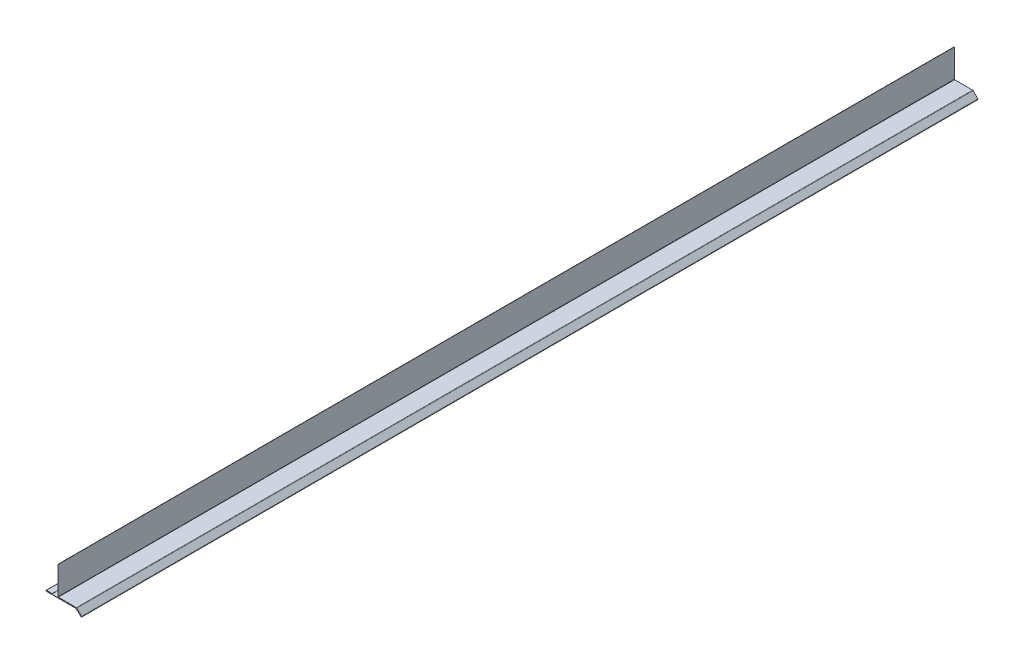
ISO-10303-21;
HEADER;
FILE_DESCRIPTION(('STEP AP214'),'2;1');
FILE_NAME('part.step','',(''),(''),'','','');
FILE_SCHEMA(('AUTOMOTIVE_DESIGN { 1 0 10303 214 1 1 1 1 }'));
ENDSEC;
DATA;
#1=APPLICATION_CONTEXT('core data for automotive mechanical design processes');
#2=APPLICATION_PROTOCOL_DEFINITION('international standard','automotive_design',2000,#1);
#3=PRODUCT_CONTEXT('',#1,'mechanical');
#4=PRODUCT('Part','Part','',(#3));
#5=PRODUCT_RELATED_PRODUCT_CATEGORY('part','',(#4));
#6=PRODUCT_DEFINITION_FORMATION('','',#4);
#7=PRODUCT_DEFINITION_CONTEXT('part definition',#1,'design');
#8=PRODUCT_DEFINITION('design','',#6,#7);
#9=PRODUCT_DEFINITION_SHAPE('','',#8);
#10=(LENGTH_UNIT() NAMED_UNIT(*) SI_UNIT(.MILLI.,.METRE.));
#11=(NAMED_UNIT(*) PLANE_ANGLE_UNIT() SI_UNIT($,.RADIAN.));
#12=(NAMED_UNIT(*) SI_UNIT($,.STERADIAN.) SOLID_ANGLE_UNIT());
#13=UNCERTAINTY_MEASURE_WITH_UNIT(LENGTH_MEASURE(1.E-05),#10,'distance_accuracy_value','');
#14=(GEOMETRIC_REPRESENTATION_CONTEXT(3) GLOBAL_UNCERTAINTY_ASSIGNED_CONTEXT((#13)) GLOBAL_UNIT_ASSIGNED_CONTEXT((#10,
#11,#12)) REPRESENTATION_CONTEXT('',''));
#15=CARTESIAN_POINT('',(0.,0.,0.));
#16=DIRECTION('',(0.,0.,1.));
#17=DIRECTION('',(1.,0.,0.));
#18=AXIS2_PLACEMENT_3D('',#15,#16,#17);
#19=CARTESIAN_POINT('',(-12.7,0.,2000.));
#20=DIRECTION('',(0.,1.,0.));
#21=DIRECTION('',(-1.,0.,0.));
#22=AXIS2_PLACEMENT_3D('',#19,#20,#21);
#23=PLANE('',#22);
#24=DIRECTION('',(1.,0.,0.));
#25=VECTOR('',#24,1.);
#26=CARTESIAN_POINT('',(-12.7,0.,0.));
#27=LINE('',#26,#25);
#28=CARTESIAN_POINT('',(-25.4,0.,0.));
#29=VERTEX_POINT('',#28);
#30=CARTESIAN_POINT('',(-12.7,0.,0.));
#31=VERTEX_POINT('',#30);
#32=EDGE_CURVE('E222',#29,#31,#27,.T.);
#33=ORIENTED_EDGE('',*,*,#32,.T.);
#34=DIRECTION('',(0.,0.,-1.));
#35=VECTOR('',#34,1.);
#36=CARTESIAN_POINT('',(-12.7,0.,2000.));
#37=LINE('',#36,#35);
#38=CARTESIAN_POINT('',(-12.7,0.,2000.));
#39=VERTEX_POINT('',#38);
#40=EDGE_CURVE('E11',#39,#31,#37,.T.);
#41=ORIENTED_EDGE('',*,*,#40,.F.);
#42=DIRECTION('',(1.,0.,0.));
#43=VECTOR('',#42,1.);
#44=CARTESIAN_POINT('',(-12.7,0.,2000.));
#45=LINE('',#44,#43);
#46=CARTESIAN_POINT('',(-25.4,0.,2000.));
#47=VERTEX_POINT('',#46);
#48=EDGE_CURVE('E138',#47,#39,#45,.T.);
#49=ORIENTED_EDGE('',*,*,#48,.F.);
#50=DIRECTION('',(0.,0.,-1.));
#51=VECTOR('',#50,1.);
#52=CARTESIAN_POINT('',(-25.4,0.,2000.));
#53=LINE('',#52,#51);
#54=EDGE_CURVE('E218',#47,#29,#53,.T.);
#55=ORIENTED_EDGE('',*,*,#54,.T.);
#56=EDGE_LOOP('',(#33,#41,#49,#55));
#57=FACE_BOUND('',#56,.T.);
#58=ADVANCED_FACE('F37',(#57),#23,.F.);
#59=CARTESIAN_POINT('',(-12.7,0.507999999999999,2000.));
#60=DIRECTION('',(1.,0.,0.));
#61=DIRECTION('',(0.,0.,-1.));
#62=AXIS2_PLACEMENT_3D('',#59,#60,#61);
#63=PLANE('',#62);
#64=DIRECTION('',(0.,-1.,0.));
#65=VECTOR('',#64,1.);
#66=CARTESIAN_POINT('',(-12.7,0.507999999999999,0.));
#67=LINE('',#66,#65);
#68=CARTESIAN_POINT('',(-12.7,0.507999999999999,0.));
#69=VERTEX_POINT('',#68);
#70=EDGE_CURVE('E225',#69,#31,#67,.T.);
#71=ORIENTED_EDGE('',*,*,#70,.F.);
#72=DIRECTION('',(0.,0.,-1.));
#73=VECTOR('',#72,1.);
#74=CARTESIAN_POINT('',(-12.7,0.507999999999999,2000.));
#75=LINE('',#74,#73);
#76=CARTESIAN_POINT('',(-12.7,0.507999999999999,2000.));
#77=VERTEX_POINT('',#76);
#78=EDGE_CURVE('E45',#77,#69,#75,.T.);
#79=ORIENTED_EDGE('',*,*,#78,.F.);
#80=DIRECTION('',(0.,-1.,0.));
#81=VECTOR('',#80,1.);
#82=CARTESIAN_POINT('',(-12.7,0.507999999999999,2000.));
#83=LINE('',#82,#81);
#84=EDGE_CURVE('E342',#77,#39,#83,.T.);
#85=ORIENTED_EDGE('',*,*,#84,.T.);
#86=ORIENTED_EDGE('',*,*,#40,.T.);
#87=EDGE_LOOP('',(#71,#79,#85,#86));
#88=FACE_BOUND('',#87,.T.);
#89=ADVANCED_FACE('F329',(#88),#63,.T.);
#90=CARTESIAN_POINT('',(-12.7,0.507999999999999,2000.));
#91=DIRECTION('',(0.,1.,0.));
#92=DIRECTION('',(-1.,0.,0.));
#93=AXIS2_PLACEMENT_3D('',#90,#91,#92);
#94=PLANE('',#93);
#95=DIRECTION('',(1.,0.,0.));
#96=VECTOR('',#95,1.);
#97=CARTESIAN_POINT('',(-12.7,0.507999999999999,0.));
#98=LINE('',#97,#96);
#99=CARTESIAN_POINT('',(-25.4,0.507999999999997,0.));
#100=VERTEX_POINT('',#99);
#101=EDGE_CURVE('E228',#100,#69,#98,.T.);
#102=ORIENTED_EDGE('',*,*,#101,.F.);
#103=DIRECTION('',(0.,0.,-1.));
#104=VECTOR('',#103,1.);
#105=CARTESIAN_POINT('',(-25.4,0.507999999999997,2000.));
#106=LINE('',#105,#104);
#107=CARTESIAN_POINT('',(-25.4,0.507999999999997,2000.));
#108=VERTEX_POINT('',#107);
#109=EDGE_CURVE('E319',#108,#100,#106,.T.);
#110=ORIENTED_EDGE('',*,*,#109,.F.);
#111=DIRECTION('',(1.,0.,0.));
#112=VECTOR('',#111,1.);
#113=CARTESIAN_POINT('',(-12.7,0.507999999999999,2000.));
#114=LINE('',#113,#112);
#115=EDGE_CURVE('E326',#108,#77,#114,.T.);
#116=ORIENTED_EDGE('',*,*,#115,.T.);
#117=ORIENTED_EDGE('',*,*,#78,.T.);
#118=EDGE_LOOP('',(#102,#110,#116,#117));
#119=FACE_BOUND('',#118,.T.);
#120=ADVANCED_FACE('F324',(#119),#94,.T.);
#121=CARTESIAN_POINT('',(-25.4,-0.508000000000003,2000.));
#122=DIRECTION('',(0.,0.,-1.));
#123=DIRECTION('',(-1.,0.,0.));
#124=AXIS2_PLACEMENT_3D('',#121,#122,#123);
#125=CYLINDRICAL_SURFACE('',#124,1.016);
#126=CARTESIAN_POINT('',(-25.4,-0.508000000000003,0.));
#127=DIRECTION('',(0.,0.,1.));
#128=DIRECTION('',(1.,0.,0.));
#129=AXIS2_PLACEMENT_3D('',#126,#127,#128);
#130=CIRCLE('',#129,1.016);
#131=CARTESIAN_POINT('',(-25.4,-1.524,0.));
#132=VERTEX_POINT('',#131);
#133=EDGE_CURVE('E231',#132,#100,#130,.F.);
#134=ORIENTED_EDGE('',*,*,#133,.F.);
#135=DIRECTION('',(0.,0.,-1.));
#136=VECTOR('',#135,1.);
#137=CARTESIAN_POINT('',(-25.4,-1.524,2000.));
#138=LINE('',#137,#136);
#139=CARTESIAN_POINT('',(-25.4,-1.524,2000.));
#140=VERTEX_POINT('',#139);
#141=EDGE_CURVE('E317',#140,#132,#138,.T.);
#142=ORIENTED_EDGE('',*,*,#141,.F.);
#143=CARTESIAN_POINT('',(-25.4,-0.508000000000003,2000.));
#144=DIRECTION('',(0.,0.,1.));
#145=DIRECTION('',(1.,0.,0.));
#146=AXIS2_PLACEMENT_3D('',#143,#144,#145);
#147=CIRCLE('',#146,1.016);
#148=EDGE_CURVE('E339',#140,#108,#147,.F.);
#149=ORIENTED_EDGE('',*,*,#148,.T.);
#150=ORIENTED_EDGE('',*,*,#109,.T.);
#151=EDGE_LOOP('',(#134,#142,#149,#150));
#152=FACE_BOUND('',#151,.T.);
#153=ADVANCED_FACE('F336',(#152),#125,.T.);
#154=CARTESIAN_POINT('',(41.0645795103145,-1.524,2000.));
#155=DIRECTION('',(0.,-1.,0.));
#156=DIRECTION('',(1.,0.,0.));
#157=AXIS2_PLACEMENT_3D('',#154,#155,#156);
#158=PLANE('',#157);
#159=DIRECTION('',(-1.,0.,0.));
#160=VECTOR('',#159,1.);
#161=CARTESIAN_POINT('',(41.0645795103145,-1.524,0.));
#162=LINE('',#161,#160);
#163=CARTESIAN_POINT('',(41.0645795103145,-1.524,0.));
#164=VERTEX_POINT('',#163);
#165=EDGE_CURVE('E234',#164,#132,#162,.T.);
#166=ORIENTED_EDGE('',*,*,#165,.F.);
#167=DIRECTION('',(0.,0.,-1.));
#168=VECTOR('',#167,1.);
#169=CARTESIAN_POINT('',(41.0645795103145,-1.524,2000.));
#170=LINE('',#169,#168);
#171=CARTESIAN_POINT('',(41.0645795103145,-1.524,2000.));
#172=VERTEX_POINT('',#171);
#173=EDGE_CURVE('E315',#172,#164,#170,.T.);
#174=ORIENTED_EDGE('',*,*,#173,.F.);
#175=DIRECTION('',(-1.,0.,0.));
#176=VECTOR('',#175,1.);
#177=CARTESIAN_POINT('',(41.0645795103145,-1.524,2000.));
#178=LINE('',#177,#176);
#179=EDGE_CURVE('E344',#172,#140,#178,.T.);
#180=ORIENTED_EDGE('',*,*,#179,.T.);
#181=ORIENTED_EDGE('',*,*,#141,.T.);
#182=EDGE_LOOP('',(#166,#174,#180,#181));
#183=FACE_BOUND('',#182,.T.);
#184=ADVANCED_FACE('F417',(#183),#158,.T.);
#185=CARTESIAN_POINT('',(51.5714791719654,-12.0308996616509,2000.));
#186=DIRECTION('',(-0.707106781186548,-0.707106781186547,0.));
#187=DIRECTION('',(0.707106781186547,-0.707106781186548,0.));
#188=AXIS2_PLACEMENT_3D('',#185,#186,#187);
#189=PLANE('',#188);
#190=DIRECTION('',(-0.707106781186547,0.707106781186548,0.));
#191=VECTOR('',#190,1.);
#192=CARTESIAN_POINT('',(51.5714791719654,-12.0308996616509,0.));
#193=LINE('',#192,#191);
#194=CARTESIAN_POINT('',(51.5714791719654,-12.0308996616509,0.));
#195=VERTEX_POINT('',#194);
#196=EDGE_CURVE('E237',#195,#164,#193,.T.);
#197=ORIENTED_EDGE('',*,*,#196,.F.);
#198=DIRECTION('',(0.,0.,-1.));
#199=VECTOR('',#198,1.);
#200=CARTESIAN_POINT('',(51.5714791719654,-12.0308996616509,2000.));
#201=LINE('',#200,#199);
#202=CARTESIAN_POINT('',(51.5714791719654,-12.0308996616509,2000.));
#203=VERTEX_POINT('',#202);
#204=EDGE_CURVE('E313',#203,#195,#201,.T.);
#205=ORIENTED_EDGE('',*,*,#204,.F.);
#206=DIRECTION('',(-0.707106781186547,0.707106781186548,0.));
#207=VECTOR('',#206,1.);
#208=CARTESIAN_POINT('',(51.5714791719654,-12.0308996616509,2000.));
#209=LINE('',#208,#207);
#210=EDGE_CURVE('E350',#203,#172,#209,.T.);
#211=ORIENTED_EDGE('',*,*,#210,.T.);
#212=ORIENTED_EDGE('',*,*,#173,.T.);
#213=EDGE_LOOP('',(#197,#205,#211,#212));
#214=FACE_BOUND('',#213,.T.);
#215=ADVANCED_FACE('F420',(#214),#189,.T.);
#216=CARTESIAN_POINT('',(52.2898996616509,-11.3124791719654,2000.));
#217=DIRECTION('',(0.,0.,-1.));
#218=DIRECTION('',(-1.,0.,0.));
#219=AXIS2_PLACEMENT_3D('',#216,#217,#218);
#220=CYLINDRICAL_SURFACE('',#219,1.01599999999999);
#221=CARTESIAN_POINT('',(52.2898996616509,-11.3124791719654,0.));
#222=DIRECTION('',(0.,0.,1.));
#223=DIRECTION('',(1.,0.,0.));
#224=AXIS2_PLACEMENT_3D('',#221,#222,#223);
#225=CIRCLE('',#224,1.01599999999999);
#226=CARTESIAN_POINT('',(53.0083201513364,-10.5940586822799,0.));
#227=VERTEX_POINT('',#226);
#228=EDGE_CURVE('E240',#227,#195,#225,.F.);
#229=ORIENTED_EDGE('',*,*,#228,.F.);
#230=DIRECTION('',(0.,0.,-1.));
#231=VECTOR('',#230,1.);
#232=CARTESIAN_POINT('',(53.0083201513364,-10.5940586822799,2000.));
#233=LINE('',#232,#231);
#234=CARTESIAN_POINT('',(53.0083201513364,-10.5940586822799,2000.));
#235=VERTEX_POINT('',#234);
#236=EDGE_CURVE('E311',#235,#227,#233,.T.);
#237=ORIENTED_EDGE('',*,*,#236,.F.);
#238=CARTESIAN_POINT('',(52.2898996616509,-11.3124791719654,2000.));
#239=DIRECTION('',(0.,0.,1.));
#240=DIRECTION('',(1.,0.,0.));
#241=AXIS2_PLACEMENT_3D('',#238,#239,#240);
#242=CIRCLE('',#241,1.01599999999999);
#243=EDGE_CURVE('E353',#235,#203,#242,.F.);
#244=ORIENTED_EDGE('',*,*,#243,.T.);
#245=ORIENTED_EDGE('',*,*,#204,.T.);
#246=EDGE_LOOP('',(#229,#237,#244,#245));
#247=FACE_BOUND('',#246,.T.);
#248=ADVANCED_FACE('F424',(#247),#220,.T.);
#249=CARTESIAN_POINT('',(42.3526307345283,0.0616307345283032,2000.));
#250=DIRECTION('',(0.707106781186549,0.707106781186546,0.));
#251=DIRECTION('',(-0.707106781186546,0.707106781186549,0.));
#252=AXIS2_PLACEMENT_3D('',#249,#250,#251);
#253=PLANE('',#252);
#254=DIRECTION('',(0.707106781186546,-0.707106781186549,0.));
#255=VECTOR('',#254,1.);
#256=CARTESIAN_POINT('',(42.3526307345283,0.0616307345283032,0.));
#257=LINE('',#256,#255);
#258=CARTESIAN_POINT('',(42.3526307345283,0.0616307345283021,0.));
#259=VERTEX_POINT('',#258);
#260=EDGE_CURVE('E243',#259,#227,#257,.T.);
#261=ORIENTED_EDGE('',*,*,#260,.F.);
#262=DIRECTION('',(0.,0.,-1.));
#263=VECTOR('',#262,1.);
#264=CARTESIAN_POINT('',(42.3526307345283,0.0616307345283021,2000.));
#265=LINE('',#264,#263);
#266=CARTESIAN_POINT('',(42.3526307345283,0.0616307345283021,2000.));
#267=VERTEX_POINT('',#266);
#268=EDGE_CURVE('E309',#267,#259,#265,.T.);
#269=ORIENTED_EDGE('',*,*,#268,.F.);
#270=DIRECTION('',(0.707106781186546,-0.707106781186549,0.));
#271=VECTOR('',#270,1.);
#272=CARTESIAN_POINT('',(42.3526307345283,0.0616307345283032,2000.));
#273=LINE('',#272,#271);
#274=EDGE_CURVE('E356',#267,#235,#273,.T.);
#275=ORIENTED_EDGE('',*,*,#274,.T.);
#276=ORIENTED_EDGE('',*,*,#236,.T.);
#277=EDGE_LOOP('',(#261,#269,#275,#276));
#278=FACE_BOUND('',#277,.T.);
#279=ADVANCED_FACE('F428',(#278),#253,.T.);
#280=CARTESIAN_POINT('',(41.275,-1.016,2000.));
#281=DIRECTION('',(0.,0.,-1.));
#282=DIRECTION('',(-1.,0.,0.));
#283=AXIS2_PLACEMENT_3D('',#280,#281,#282);
#284=CYLINDRICAL_SURFACE('',#283,1.524);
#285=CARTESIAN_POINT('',(41.275,-1.016,0.));
#286=DIRECTION('',(0.,0.,1.));
#287=DIRECTION('',(1.,0.,0.));
#288=AXIS2_PLACEMENT_3D('',#285,#286,#287);
#289=CIRCLE('',#288,1.524);
#290=CARTESIAN_POINT('',(41.275,0.508000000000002,0.));
#291=VERTEX_POINT('',#290);
#292=EDGE_CURVE('E246',#291,#259,#289,.F.);
#293=ORIENTED_EDGE('',*,*,#292,.F.);
#294=DIRECTION('',(0.,0.,-1.));
#295=VECTOR('',#294,1.);
#296=CARTESIAN_POINT('',(41.275,0.508000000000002,2000.));
#297=LINE('',#296,#295);
#298=CARTESIAN_POINT('',(41.275,0.508000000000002,2000.));
#299=VERTEX_POINT('',#298);
#300=EDGE_CURVE('E307',#299,#291,#297,.T.);
#301=ORIENTED_EDGE('',*,*,#300,.F.);
#302=CARTESIAN_POINT('',(41.275,-1.016,2000.));
#303=DIRECTION('',(0.,0.,1.));
#304=DIRECTION('',(1.,0.,0.));
#305=AXIS2_PLACEMENT_3D('',#302,#303,#304);
#306=CIRCLE('',#305,1.524);
#307=EDGE_CURVE('E359',#299,#267,#306,.F.);
#308=ORIENTED_EDGE('',*,*,#307,.T.);
#309=ORIENTED_EDGE('',*,*,#268,.T.);
#310=EDGE_LOOP('',(#293,#301,#308,#309));
#311=FACE_BOUND('',#310,.T.);
#312=ADVANCED_FACE('F432',(#311),#284,.T.);
#313=CARTESIAN_POINT('',(1.,0.508,2000.));
#314=DIRECTION('',(0.,1.,0.));
#315=DIRECTION('',(0.,0.,1.));
#316=AXIS2_PLACEMENT_3D('',#313,#314,#315);
#317=PLANE('',#316);
#318=DIRECTION('',(1.,0.,0.));
#319=VECTOR('',#318,1.);
#320=CARTESIAN_POINT('',(1.,0.508,0.));
#321=LINE('',#320,#319);
#322=CARTESIAN_POINT('',(1.,0.508,0.));
#323=VERTEX_POINT('',#322);
#324=EDGE_CURVE('E249',#323,#291,#321,.T.);
#325=ORIENTED_EDGE('',*,*,#324,.F.);
#326=DIRECTION('',(0.,0.,-1.));
#327=VECTOR('',#326,1.);
#328=CARTESIAN_POINT('',(1.,0.508,2000.));
#329=LINE('',#328,#327);
#330=CARTESIAN_POINT('',(1.,0.508,2000.));
#331=VERTEX_POINT('',#330);
#332=EDGE_CURVE('E305',#331,#323,#329,.T.);
#333=ORIENTED_EDGE('',*,*,#332,.F.);
#334=DIRECTION('',(1.,0.,0.));
#335=VECTOR('',#334,1.);
#336=CARTESIAN_POINT('',(1.,0.508,2000.));
#337=LINE('',#336,#335);
#338=EDGE_CURVE('E362',#331,#299,#337,.T.);
#339=ORIENTED_EDGE('',*,*,#338,.T.);
#340=ORIENTED_EDGE('',*,*,#300,.T.);
#341=EDGE_LOOP('',(#325,#333,#339,#340));
#342=FACE_BOUND('',#341,.T.);
#343=ADVANCED_FACE('F436',(#342),#317,.T.);
#344=CARTESIAN_POINT('',(1.,1.,2000.));
#345=DIRECTION('',(0.,0.,-1.));
#346=DIRECTION('',(-1.,0.,0.));
#347=AXIS2_PLACEMENT_3D('',#344,#345,#346);
#348=CYLINDRICAL_SURFACE('',#347,0.492);
#349=CARTESIAN_POINT('',(1.,1.,0.));
#350=DIRECTION('',(0.,0.,1.));
#351=DIRECTION('',(1.,0.,0.));
#352=AXIS2_PLACEMENT_3D('',#349,#350,#351);
#353=CIRCLE('',#352,0.492);
#354=CARTESIAN_POINT('',(0.508,1.,0.));
#355=VERTEX_POINT('',#354);
#356=EDGE_CURVE('E252',#355,#323,#353,.T.);
#357=ORIENTED_EDGE('',*,*,#356,.F.);
#358=DIRECTION('',(0.,0.,-1.));
#359=VECTOR('',#358,1.);
#360=CARTESIAN_POINT('',(0.508,1.,2000.));
#361=LINE('',#360,#359);
#362=CARTESIAN_POINT('',(0.508,1.,2000.));
#363=VERTEX_POINT('',#362);
#364=EDGE_CURVE('E303',#363,#355,#361,.T.);
#365=ORIENTED_EDGE('',*,*,#364,.F.);
#366=CARTESIAN_POINT('',(1.,1.,2000.));
#367=DIRECTION('',(0.,0.,1.));
#368=DIRECTION('',(1.,0.,0.));
#369=AXIS2_PLACEMENT_3D('',#366,#367,#368);
#370=CIRCLE('',#369,0.492);
#371=EDGE_CURVE('E365',#363,#331,#370,.T.);
#372=ORIENTED_EDGE('',*,*,#371,.T.);
#373=ORIENTED_EDGE('',*,*,#332,.T.);
#374=EDGE_LOOP('',(#357,#365,#372,#373));
#375=FACE_BOUND('',#374,.T.);
#376=ADVANCED_FACE('F440',(#375),#348,.F.);
#377=CARTESIAN_POINT('',(0.508,1.,2000.));
#378=DIRECTION('',(1.,0.,0.));
#379=DIRECTION('',(0.,0.,-1.));
#380=AXIS2_PLACEMENT_3D('',#377,#378,#379);
#381=PLANE('',#380);
#382=DIRECTION('',(0.,1.,0.));
#383=VECTOR('',#382,1.);
#384=CARTESIAN_POINT('',(0.508,1.,0.));
#385=LINE('',#384,#383);
#386=CARTESIAN_POINT('',(0.508,63.5,0.));
#387=VERTEX_POINT('',#386);
#388=EDGE_CURVE('E255',#387,#355,#385,.F.);
#389=ORIENTED_EDGE('',*,*,#388,.F.);
#390=DIRECTION('',(0.,0.,-1.));
#391=VECTOR('',#390,1.);
#392=CARTESIAN_POINT('',(0.508,63.5,2000.));
#393=LINE('',#392,#391);
#394=CARTESIAN_POINT('',(0.508,63.5,2000.));
#395=VERTEX_POINT('',#394);
#396=EDGE_CURVE('E301',#395,#387,#393,.T.);
#397=ORIENTED_EDGE('',*,*,#396,.F.);
#398=DIRECTION('',(0.,1.,0.));
#399=VECTOR('',#398,1.);
#400=CARTESIAN_POINT('',(0.508,1.,2000.));
#401=LINE('',#400,#399);
#402=EDGE_CURVE('E368',#395,#363,#401,.F.);
#403=ORIENTED_EDGE('',*,*,#402,.T.);
#404=ORIENTED_EDGE('',*,*,#364,.T.);
#405=EDGE_LOOP('',(#389,#397,#403,#404));
#406=FACE_BOUND('',#405,.T.);
#407=ADVANCED_FACE('F444',(#406),#381,.T.);
#408=CARTESIAN_POINT('',(0.,63.5,2000.));
#409=DIRECTION('',(0.,1.,0.));
#410=DIRECTION('',(0.,0.,1.));
#411=AXIS2_PLACEMENT_3D('',#408,#409,#410);
#412=PLANE('',#411);
#413=DIRECTION('',(1.,0.,0.));
#414=VECTOR('',#413,1.);
#415=CARTESIAN_POINT('',(0.,63.5,0.));
#416=LINE('',#415,#414);
#417=CARTESIAN_POINT('',(0.,63.5,0.));
#418=VERTEX_POINT('',#417);
#419=EDGE_CURVE('E258',#418,#387,#416,.T.);
#420=ORIENTED_EDGE('',*,*,#419,.F.);
#421=DIRECTION('',(0.,0.,-1.));
#422=VECTOR('',#421,1.);
#423=CARTESIAN_POINT('',(0.,63.5,2000.));
#424=LINE('',#423,#422);
#425=CARTESIAN_POINT('',(0.,63.5,2000.));
#426=VERTEX_POINT('',#425);
#427=EDGE_CURVE('E299',#426,#418,#424,.T.);
#428=ORIENTED_EDGE('',*,*,#427,.F.);
#429=DIRECTION('',(1.,0.,0.));
#430=VECTOR('',#429,1.);
#431=CARTESIAN_POINT('',(0.,63.5,2000.));
#432=LINE('',#431,#430);
#433=EDGE_CURVE('E371',#426,#395,#432,.T.);
#434=ORIENTED_EDGE('',*,*,#433,.T.);
#435=ORIENTED_EDGE('',*,*,#396,.T.);
#436=EDGE_LOOP('',(#420,#428,#434,#435));
#437=FACE_BOUND('',#436,.T.);
#438=ADVANCED_FACE('F448',(#437),#412,.T.);
#439=CARTESIAN_POINT('',(0.,1.,2000.));
#440=DIRECTION('',(1.,0.,0.));
#441=DIRECTION('',(0.,0.,-1.));
#442=AXIS2_PLACEMENT_3D('',#439,#440,#441);
#443=PLANE('',#442);
#444=DIRECTION('',(0.,-1.,0.));
#445=VECTOR('',#444,1.);
#446=CARTESIAN_POINT('',(0.,1.,0.));
#447=LINE('',#446,#445);
#448=CARTESIAN_POINT('',(0.,1.,0.));
#449=VERTEX_POINT('',#448);
#450=EDGE_CURVE('E261',#418,#449,#447,.T.);
#451=ORIENTED_EDGE('',*,*,#450,.T.);
#452=DIRECTION('',(0.,0.,-1.));
#453=VECTOR('',#452,1.);
#454=CARTESIAN_POINT('',(0.,1.,2000.));
#455=LINE('',#454,#453);
#456=CARTESIAN_POINT('',(0.,1.,2000.));
#457=VERTEX_POINT('',#456);
#458=EDGE_CURVE('E296',#457,#449,#455,.T.);
#459=ORIENTED_EDGE('',*,*,#458,.F.);
#460=DIRECTION('',(0.,-1.,0.));
#461=VECTOR('',#460,1.);
#462=CARTESIAN_POINT('',(0.,1.,2000.));
#463=LINE('',#462,#461);
#464=EDGE_CURVE('E374',#426,#457,#463,.T.);
#465=ORIENTED_EDGE('',*,*,#464,.F.);
#466=ORIENTED_EDGE('',*,*,#427,.T.);
#467=EDGE_LOOP('',(#451,#459,#465,#466));
#468=FACE_BOUND('',#467,.T.);
#469=ADVANCED_FACE('F452',(#468),#443,.F.);
#470=CARTESIAN_POINT('',(1.,1.,2000.));
#471=DIRECTION('',(0.,0.,-1.));
#472=DIRECTION('',(-1.,0.,0.));
#473=AXIS2_PLACEMENT_3D('',#470,#471,#472);
#474=CYLINDRICAL_SURFACE('',#473,1.);
#475=CARTESIAN_POINT('',(1.,1.,0.));
#476=DIRECTION('',(0.,0.,1.));
#477=DIRECTION('',(1.,0.,0.));
#478=AXIS2_PLACEMENT_3D('',#475,#476,#477);
#479=CIRCLE('',#478,1.);
#480=CARTESIAN_POINT('',(1.,0.,0.));
#481=VERTEX_POINT('',#480);
#482=EDGE_CURVE('E263',#449,#481,#479,.T.);
#483=ORIENTED_EDGE('',*,*,#482,.T.);
#484=DIRECTION('',(0.,0.,-1.));
#485=VECTOR('',#484,1.);
#486=CARTESIAN_POINT('',(1.,0.,2000.));
#487=LINE('',#486,#485);
#488=CARTESIAN_POINT('',(1.,0.,2000.));
#489=VERTEX_POINT('',#488);
#490=EDGE_CURVE('E293',#489,#481,#487,.T.);
#491=ORIENTED_EDGE('',*,*,#490,.F.);
#492=CARTESIAN_POINT('',(1.,1.,2000.));
#493=DIRECTION('',(0.,0.,1.));
#494=DIRECTION('',(1.,0.,0.));
#495=AXIS2_PLACEMENT_3D('',#492,#493,#494);
#496=CIRCLE('',#495,1.);
#497=EDGE_CURVE('E376',#457,#489,#496,.T.);
#498=ORIENTED_EDGE('',*,*,#497,.F.);
#499=ORIENTED_EDGE('',*,*,#458,.T.);
#500=EDGE_LOOP('',(#483,#491,#498,#499));
#501=FACE_BOUND('',#500,.T.);
#502=ADVANCED_FACE('F456',(#501),#474,.T.);
#503=CARTESIAN_POINT('',(1.,0.,2000.));
#504=DIRECTION('',(0.,1.,0.));
#505=DIRECTION('',(0.,0.,1.));
#506=AXIS2_PLACEMENT_3D('',#503,#504,#505);
#507=PLANE('',#506);
#508=DIRECTION('',(1.,0.,0.));
#509=VECTOR('',#508,1.);
#510=CARTESIAN_POINT('',(1.,0.,0.));
#511=LINE('',#510,#509);
#512=CARTESIAN_POINT('',(41.275,0.,0.));
#513=VERTEX_POINT('',#512);
#514=EDGE_CURVE('E265',#481,#513,#511,.T.);
#515=ORIENTED_EDGE('',*,*,#514,.T.);
#516=DIRECTION('',(0.,0.,-1.));
#517=VECTOR('',#516,1.);
#518=CARTESIAN_POINT('',(41.275,0.,2000.));
#519=LINE('',#518,#517);
#520=CARTESIAN_POINT('',(41.275,0.,2000.));
#521=VERTEX_POINT('',#520);
#522=EDGE_CURVE('E290',#521,#513,#519,.T.);
#523=ORIENTED_EDGE('',*,*,#522,.F.);
#524=DIRECTION('',(1.,0.,0.));
#525=VECTOR('',#524,1.);
#526=CARTESIAN_POINT('',(1.,0.,2000.));
#527=LINE('',#526,#525);
#528=EDGE_CURVE('E378',#489,#521,#527,.T.);
#529=ORIENTED_EDGE('',*,*,#528,.F.);
#530=ORIENTED_EDGE('',*,*,#490,.T.);
#531=EDGE_LOOP('',(#515,#523,#529,#530));
#532=FACE_BOUND('',#531,.T.);
#533=ADVANCED_FACE('F460',(#532),#507,.F.);
#534=CARTESIAN_POINT('',(41.275,-1.016,2000.));
#535=DIRECTION('',(0.,0.,-1.));
#536=DIRECTION('',(-1.,0.,0.));
#537=AXIS2_PLACEMENT_3D('',#534,#535,#536);
#538=CYLINDRICAL_SURFACE('',#537,1.016);
#539=CARTESIAN_POINT('',(41.275,-1.016,0.));
#540=DIRECTION('',(0.,0.,-1.));
#541=DIRECTION('',(1.,0.,0.));
#542=AXIS2_PLACEMENT_3D('',#539,#540,#541);
#543=CIRCLE('',#542,1.016);
#544=CARTESIAN_POINT('',(41.9934204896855,-0.297579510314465,0.));
#545=VERTEX_POINT('',#544);
#546=EDGE_CURVE('E267',#513,#545,#543,.T.);
#547=ORIENTED_EDGE('',*,*,#546,.T.);
#548=DIRECTION('',(0.,0.,-1.));
#549=VECTOR('',#548,1.);
#550=CARTESIAN_POINT('',(41.9934204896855,-0.297579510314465,2000.));
#551=LINE('',#550,#549);
#552=CARTESIAN_POINT('',(41.9934204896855,-0.297579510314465,2000.));
#553=VERTEX_POINT('',#552);
#554=EDGE_CURVE('E287',#553,#545,#551,.T.);
#555=ORIENTED_EDGE('',*,*,#554,.F.);
#556=CARTESIAN_POINT('',(41.275,-1.016,2000.));
#557=DIRECTION('',(0.,0.,-1.));
#558=DIRECTION('',(1.,0.,0.));
#559=AXIS2_PLACEMENT_3D('',#556,#557,#558);
#560=CIRCLE('',#559,1.016);
#561=EDGE_CURVE('E380',#521,#553,#560,.T.);
#562=ORIENTED_EDGE('',*,*,#561,.F.);
#563=ORIENTED_EDGE('',*,*,#522,.T.);
#564=EDGE_LOOP('',(#547,#555,#562,#563));
#565=FACE_BOUND('',#564,.T.);
#566=ADVANCED_FACE('F464',(#565),#538,.F.);
#567=CARTESIAN_POINT('',(41.9934204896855,-0.297579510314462,2000.));
#568=DIRECTION('',(0.707106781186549,0.707106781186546,0.));
#569=DIRECTION('',(-0.707106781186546,0.707106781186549,0.));
#570=AXIS2_PLACEMENT_3D('',#567,#568,#569);
#571=PLANE('',#570);
#572=DIRECTION('',(0.707106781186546,-0.707106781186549,0.));
#573=VECTOR('',#572,1.);
#574=CARTESIAN_POINT('',(41.9934204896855,-0.297579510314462,0.));
#575=LINE('',#574,#573);
#576=CARTESIAN_POINT('',(52.6491099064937,-10.9532689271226,0.));
#577=VERTEX_POINT('',#576);
#578=EDGE_CURVE('E269',#545,#577,#575,.T.);
#579=ORIENTED_EDGE('',*,*,#578,.T.);
#580=DIRECTION('',(0.,0.,-1.));
#581=VECTOR('',#580,1.);
#582=CARTESIAN_POINT('',(52.6491099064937,-10.9532689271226,2000.));
#583=LINE('',#582,#581);
#584=CARTESIAN_POINT('',(52.6491099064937,-10.9532689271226,2000.));
#585=VERTEX_POINT('',#584);
#586=EDGE_CURVE('E284',#585,#577,#583,.T.);
#587=ORIENTED_EDGE('',*,*,#586,.F.);
#588=DIRECTION('',(0.707106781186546,-0.707106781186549,0.));
#589=VECTOR('',#588,1.);
#590=CARTESIAN_POINT('',(41.9934204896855,-0.297579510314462,2000.));
#591=LINE('',#590,#589);
#592=EDGE_CURVE('E382',#553,#585,#591,.T.);
#593=ORIENTED_EDGE('',*,*,#592,.F.);
#594=ORIENTED_EDGE('',*,*,#554,.T.);
#595=EDGE_LOOP('',(#579,#587,#593,#594));
#596=FACE_BOUND('',#595,.T.);
#597=ADVANCED_FACE('F468',(#596),#571,.F.);
#598=CARTESIAN_POINT('',(52.2898996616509,-11.3124791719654,2000.));
#599=DIRECTION('',(0.,0.,-1.));
#600=DIRECTION('',(-1.,0.,0.));
#601=AXIS2_PLACEMENT_3D('',#598,#599,#600);
#602=CYLINDRICAL_SURFACE('',#601,0.507999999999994);
#603=CARTESIAN_POINT('',(52.2898996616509,-11.3124791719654,0.));
#604=DIRECTION('',(0.,0.,-1.));
#605=DIRECTION('',(-1.,0.,0.));
#606=AXIS2_PLACEMENT_3D('',#603,#604,#605);
#607=CIRCLE('',#606,0.507999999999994);
#608=CARTESIAN_POINT('',(51.9306894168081,-11.6716894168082,0.));
#609=VERTEX_POINT('',#608);
#610=EDGE_CURVE('E271',#577,#609,#607,.T.);
#611=ORIENTED_EDGE('',*,*,#610,.T.);
#612=DIRECTION('',(0.,0.,-1.));
#613=VECTOR('',#612,1.);
#614=CARTESIAN_POINT('',(51.9306894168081,-11.6716894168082,2000.));
#615=LINE('',#614,#613);
#616=CARTESIAN_POINT('',(51.9306894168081,-11.6716894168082,2000.));
#617=VERTEX_POINT('',#616);
#618=EDGE_CURVE('E281',#617,#609,#615,.T.);
#619=ORIENTED_EDGE('',*,*,#618,.F.);
#620=CARTESIAN_POINT('',(52.2898996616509,-11.3124791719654,2000.));
#621=DIRECTION('',(0.,0.,-1.));
#622=DIRECTION('',(-1.,0.,0.));
#623=AXIS2_PLACEMENT_3D('',#620,#621,#622);
#624=CIRCLE('',#623,0.507999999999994);
#625=EDGE_CURVE('E384',#585,#617,#624,.T.);
#626=ORIENTED_EDGE('',*,*,#625,.F.);
#627=ORIENTED_EDGE('',*,*,#586,.T.);
#628=EDGE_LOOP('',(#611,#619,#626,#627));
#629=FACE_BOUND('',#628,.T.);
#630=ADVANCED_FACE('F390',(#629),#602,.F.);
#631=CARTESIAN_POINT('',(51.9306894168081,-11.6716894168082,2000.));
#632=DIRECTION('',(-0.707106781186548,-0.707106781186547,0.));
#633=DIRECTION('',(0.707106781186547,-0.707106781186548,0.));
#634=AXIS2_PLACEMENT_3D('',#631,#632,#633);
#635=PLANE('',#634);
#636=DIRECTION('',(-0.707106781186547,0.707106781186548,0.));
#637=VECTOR('',#636,1.);
#638=CARTESIAN_POINT('',(51.9306894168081,-11.6716894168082,0.));
#639=LINE('',#638,#637);
#640=CARTESIAN_POINT('',(41.4237897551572,-1.16478975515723,0.));
#641=VERTEX_POINT('',#640);
#642=EDGE_CURVE('E273',#609,#641,#639,.T.);
#643=ORIENTED_EDGE('',*,*,#642,.T.);
#644=DIRECTION('',(0.,0.,-1.));
#645=VECTOR('',#644,1.);
#646=CARTESIAN_POINT('',(41.4237897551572,-1.16478975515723,2000.));
#647=LINE('',#646,#645);
#648=CARTESIAN_POINT('',(41.4237897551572,-1.16478975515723,2000.));
#649=VERTEX_POINT('',#648);
#650=EDGE_CURVE('E213',#649,#641,#647,.T.);
#651=ORIENTED_EDGE('',*,*,#650,.F.);
#652=DIRECTION('',(-0.707106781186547,0.707106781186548,0.));
#653=VECTOR('',#652,1.);
#654=CARTESIAN_POINT('',(51.9306894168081,-11.6716894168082,2000.));
#655=LINE('',#654,#653);
#656=EDGE_CURVE('E204',#617,#649,#655,.T.);
#657=ORIENTED_EDGE('',*,*,#656,.F.);
#658=ORIENTED_EDGE('',*,*,#618,.T.);
#659=EDGE_LOOP('',(#643,#651,#657,#658));
#660=FACE_BOUND('',#659,.T.);
#661=ADVANCED_FACE('F394',(#660),#635,.F.);
#662=CARTESIAN_POINT('',(41.0645795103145,-1.524,2000.));
#663=DIRECTION('',(0.,0.,-1.));
#664=DIRECTION('',(-1.,0.,0.));
#665=AXIS2_PLACEMENT_3D('',#662,#663,#664);
#666=CYLINDRICAL_SURFACE('',#665,0.508000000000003);
#667=CARTESIAN_POINT('',(41.0645795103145,-1.524,0.));
#668=DIRECTION('',(0.,0.,1.));
#669=DIRECTION('',(-1.,0.,0.));
#670=AXIS2_PLACEMENT_3D('',#667,#668,#669);
#671=CIRCLE('',#670,0.508000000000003);
#672=CARTESIAN_POINT('',(41.0645795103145,-1.01599999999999,0.));
#673=VERTEX_POINT('',#672);
#674=EDGE_CURVE('E212',#641,#673,#671,.T.);
#675=ORIENTED_EDGE('',*,*,#674,.T.);
#676=DIRECTION('',(0.,0.,-1.));
#677=VECTOR('',#676,1.);
#678=CARTESIAN_POINT('',(41.0645795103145,-1.01599999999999,2000.));
#679=LINE('',#678,#677);
#680=CARTESIAN_POINT('',(41.0645795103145,-1.01599999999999,2000.));
#681=VERTEX_POINT('',#680);
#682=EDGE_CURVE('E209',#681,#673,#679,.T.);
#683=ORIENTED_EDGE('',*,*,#682,.F.);
#684=CARTESIAN_POINT('',(41.0645795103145,-1.524,2000.));
#685=DIRECTION('',(0.,0.,1.));
#686=DIRECTION('',(-1.,0.,0.));
#687=AXIS2_PLACEMENT_3D('',#684,#685,#686);
#688=CIRCLE('',#687,0.508000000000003);
#689=EDGE_CURVE('E198',#649,#681,#688,.T.);
#690=ORIENTED_EDGE('',*,*,#689,.F.);
#691=ORIENTED_EDGE('',*,*,#650,.T.);
#692=EDGE_LOOP('',(#675,#683,#690,#691));
#693=FACE_BOUND('',#692,.T.);
#694=ADVANCED_FACE('F210',(#693),#666,.T.);
#695=CARTESIAN_POINT('',(41.0645795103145,-1.016,2000.));
#696=DIRECTION('',(0.,-1.,0.));
#697=DIRECTION('',(1.,0.,0.));
#698=AXIS2_PLACEMENT_3D('',#695,#696,#697);
#699=PLANE('',#698);
#700=DIRECTION('',(-1.,0.,0.));
#701=VECTOR('',#700,1.);
#702=CARTESIAN_POINT('',(41.0645795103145,-1.016,0.));
#703=LINE('',#702,#701);
#704=CARTESIAN_POINT('',(-25.4,-1.01600000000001,0.));
#705=VERTEX_POINT('',#704);
#706=EDGE_CURVE('E126',#673,#705,#703,.T.);
#707=ORIENTED_EDGE('',*,*,#706,.T.);
#708=DIRECTION('',(0.,0.,-1.));
#709=VECTOR('',#708,1.);
#710=CARTESIAN_POINT('',(-25.4,-1.01600000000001,2000.));
#711=LINE('',#710,#709);
#712=CARTESIAN_POINT('',(-25.4,-1.01600000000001,2000.));
#713=VERTEX_POINT('',#712);
#714=EDGE_CURVE('E214',#713,#705,#711,.T.);
#715=ORIENTED_EDGE('',*,*,#714,.F.);
#716=DIRECTION('',(-1.,0.,0.));
#717=VECTOR('',#716,1.);
#718=CARTESIAN_POINT('',(41.0645795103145,-1.016,2000.));
#719=LINE('',#718,#717);
#720=EDGE_CURVE('E202',#681,#713,#719,.T.);
#721=ORIENTED_EDGE('',*,*,#720,.F.);
#722=ORIENTED_EDGE('',*,*,#682,.T.);
#723=EDGE_LOOP('',(#707,#715,#721,#722));
#724=FACE_BOUND('',#723,.T.);
#725=ADVANCED_FACE('F216',(#724),#699,.F.);
#726=CARTESIAN_POINT('',(-25.4,-0.508000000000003,2000.));
#727=DIRECTION('',(0.,0.,-1.));
#728=DIRECTION('',(-1.,0.,0.));
#729=AXIS2_PLACEMENT_3D('',#726,#727,#728);
#730=CYLINDRICAL_SURFACE('',#729,0.508000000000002);
#731=CARTESIAN_POINT('',(-25.4,-0.508000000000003,0.));
#732=DIRECTION('',(0.,0.,-1.));
#733=DIRECTION('',(-1.,0.,0.));
#734=AXIS2_PLACEMENT_3D('',#731,#732,#733);
#735=CIRCLE('',#734,0.508000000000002);
#736=EDGE_CURVE('E132',#705,#29,#735,.T.);
#737=ORIENTED_EDGE('',*,*,#736,.T.);
#738=ORIENTED_EDGE('',*,*,#54,.F.);
#739=CARTESIAN_POINT('',(-25.4,-0.508000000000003,2000.));
#740=DIRECTION('',(0.,0.,-1.));
#741=DIRECTION('',(-1.,0.,0.));
#742=AXIS2_PLACEMENT_3D('',#739,#740,#741);
#743=CIRCLE('',#742,0.508000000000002);
#744=EDGE_CURVE('E53',#713,#47,#743,.T.);
#745=ORIENTED_EDGE('',*,*,#744,.F.);
#746=ORIENTED_EDGE('',*,*,#714,.T.);
#747=EDGE_LOOP('',(#737,#738,#745,#746));
#748=FACE_BOUND('',#747,.T.);
#749=ADVANCED_FACE('F396',(#748),#730,.F.);
#750=CARTESIAN_POINT('',(-25.4,-0.508000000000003,2000.));
#751=DIRECTION('',(0.,0.,1.));
#752=DIRECTION('',(1.,0.,0.));
#753=AXIS2_PLACEMENT_3D('',#750,#751,#752);
#754=PLANE('',#753);
#755=ORIENTED_EDGE('',*,*,#48,.T.);
#756=ORIENTED_EDGE('',*,*,#84,.F.);
#757=ORIENTED_EDGE('',*,*,#115,.F.);
#758=ORIENTED_EDGE('',*,*,#148,.F.);
#759=ORIENTED_EDGE('',*,*,#179,.F.);
#760=ORIENTED_EDGE('',*,*,#210,.F.);
#761=ORIENTED_EDGE('',*,*,#243,.F.);
#762=ORIENTED_EDGE('',*,*,#274,.F.);
#763=ORIENTED_EDGE('',*,*,#307,.F.);
#764=ORIENTED_EDGE('',*,*,#338,.F.);
#765=ORIENTED_EDGE('',*,*,#371,.F.);
#766=ORIENTED_EDGE('',*,*,#402,.F.);
#767=ORIENTED_EDGE('',*,*,#433,.F.);
#768=ORIENTED_EDGE('',*,*,#464,.T.);
#769=ORIENTED_EDGE('',*,*,#497,.T.);
#770=ORIENTED_EDGE('',*,*,#528,.T.);
#771=ORIENTED_EDGE('',*,*,#561,.T.);
#772=ORIENTED_EDGE('',*,*,#592,.T.);
#773=ORIENTED_EDGE('',*,*,#625,.T.);
#774=ORIENTED_EDGE('',*,*,#656,.T.);
#775=ORIENTED_EDGE('',*,*,#689,.T.);
#776=ORIENTED_EDGE('',*,*,#720,.T.);
#777=ORIENTED_EDGE('',*,*,#744,.T.);
#778=EDGE_LOOP('',(#755,#756,#757,#758,#759,#760,#761,#762,#763,#764,#765,#766,#767,#768,#769,
#770,#771,#772,#773,#774,#775,#776,#777));
#779=FACE_BOUND('',#778,.T.);
#780=ADVANCED_FACE('F200',(#779),#754,.T.);
#781=CARTESIAN_POINT('',(-25.4,-0.508000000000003,0.));
#782=DIRECTION('',(0.,0.,1.));
#783=DIRECTION('',(1.,0.,0.));
#784=AXIS2_PLACEMENT_3D('',#781,#782,#783);
#785=PLANE('',#784);
#786=ORIENTED_EDGE('',*,*,#32,.F.);
#787=ORIENTED_EDGE('',*,*,#736,.F.);
#788=ORIENTED_EDGE('',*,*,#706,.F.);
#789=ORIENTED_EDGE('',*,*,#674,.F.);
#790=ORIENTED_EDGE('',*,*,#642,.F.);
#791=ORIENTED_EDGE('',*,*,#610,.F.);
#792=ORIENTED_EDGE('',*,*,#578,.F.);
#793=ORIENTED_EDGE('',*,*,#546,.F.);
#794=ORIENTED_EDGE('',*,*,#514,.F.);
#795=ORIENTED_EDGE('',*,*,#482,.F.);
#796=ORIENTED_EDGE('',*,*,#450,.F.);
#797=ORIENTED_EDGE('',*,*,#419,.T.);
#798=ORIENTED_EDGE('',*,*,#388,.T.);
#799=ORIENTED_EDGE('',*,*,#356,.T.);
#800=ORIENTED_EDGE('',*,*,#324,.T.);
#801=ORIENTED_EDGE('',*,*,#292,.T.);
#802=ORIENTED_EDGE('',*,*,#260,.T.);
#803=ORIENTED_EDGE('',*,*,#228,.T.);
#804=ORIENTED_EDGE('',*,*,#196,.T.);
#805=ORIENTED_EDGE('',*,*,#165,.T.);
#806=ORIENTED_EDGE('',*,*,#133,.T.);
#807=ORIENTED_EDGE('',*,*,#101,.T.);
#808=ORIENTED_EDGE('',*,*,#70,.T.);
#809=EDGE_LOOP('',(#786,#787,#788,#789,#790,#791,#792,#793,#794,#795,#796,#797,#798,#799,#800,
#801,#802,#803,#804,#805,#806,#807,#808));
#810=FACE_BOUND('',#809,.T.);
#811=ADVANCED_FACE('F332',(#810),#785,.F.);
#812=CLOSED_SHELL('',(#58,#89,#120,#153,#184,#215,#248,#279,#312,#343,#376,#407,#438,#469,#502,
#533,#566,#597,#630,#661,#694,#725,#749,#780,#811));
#813=MANIFOLD_SOLID_BREP('B2',#812);
#814=ADVANCED_BREP_SHAPE_REPRESENTATION('',(#18,#813),#14);
#815=SHAPE_DEFINITION_REPRESENTATION(#9,#814);
ENDSEC;
END-ISO-10303-21;
